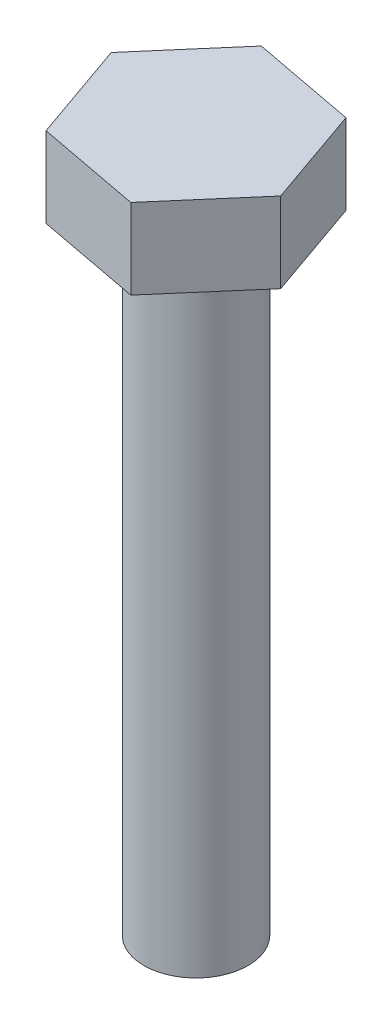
from build123d import *

# Parameters (mm, degrees)
BOSS_EXTRUDE1_DEPTH = 5.08
SKETCH2_R           = 3.3
BOSS_EXTRUDE2_DEPTH = 39.37


with BuildPart() as part:
    # Sketch1 → Boss-Extrude1 (new body)
    with BuildSketch(Plane(origin=(0, 39.37, 0), x_dir=(1, 0, 0), z_dir=(0, 1, 0))):
        Polygon((-37.092881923, -105.73006513), (-39.315060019, -99.38006513), (-45.925410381, -98.129527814), (-50.313582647, -103.228990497), (-48.091404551, -109.578990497), (-41.481054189, -110.829527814), align=None)
    extrude(amount=BOSS_EXTRUDE1_DEPTH)

    # Sketch2 → Boss-Extrude2 (add)
    with BuildSketch(Plane.XZ.offset(-39.37)):
        with Locations(Location((-43.703232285, 104.479527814, 0), (0, 0, 90))):
            Circle(SKETCH2_R)
    extrude(amount=BOSS_EXTRUDE2_DEPTH)


solid = part.part
